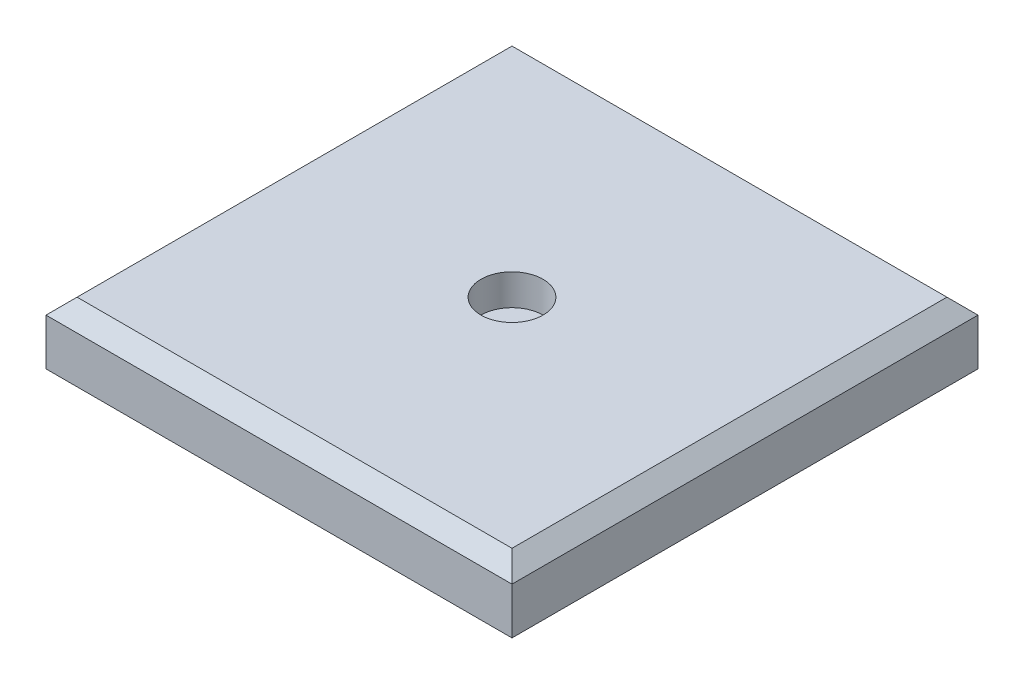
ISO-10303-21;
HEADER;
FILE_DESCRIPTION(('STEP AP214'),'2;1');
FILE_NAME('part.step','',(''),(''),'','','');
FILE_SCHEMA(('AUTOMOTIVE_DESIGN { 1 0 10303 214 1 1 1 1 }'));
ENDSEC;
DATA;
#1=APPLICATION_CONTEXT('core data for automotive mechanical design processes');
#2=APPLICATION_PROTOCOL_DEFINITION('international standard','automotive_design',2000,#1);
#3=PRODUCT_CONTEXT('',#1,'mechanical');
#4=PRODUCT('Part','Part','',(#3));
#5=PRODUCT_RELATED_PRODUCT_CATEGORY('part','',(#4));
#6=PRODUCT_DEFINITION_FORMATION('','',#4);
#7=PRODUCT_DEFINITION_CONTEXT('part definition',#1,'design');
#8=PRODUCT_DEFINITION('design','',#6,#7);
#9=PRODUCT_DEFINITION_SHAPE('','',#8);
#10=(LENGTH_UNIT() NAMED_UNIT(*) SI_UNIT(.MILLI.,.METRE.));
#11=(NAMED_UNIT(*) PLANE_ANGLE_UNIT() SI_UNIT($,.RADIAN.));
#12=(NAMED_UNIT(*) SI_UNIT($,.STERADIAN.) SOLID_ANGLE_UNIT());
#13=UNCERTAINTY_MEASURE_WITH_UNIT(LENGTH_MEASURE(1.E-05),#10,'distance_accuracy_value','');
#14=(GEOMETRIC_REPRESENTATION_CONTEXT(3) GLOBAL_UNCERTAINTY_ASSIGNED_CONTEXT((#13)) GLOBAL_UNIT_ASSIGNED_CONTEXT((#10,
#11,#12)) REPRESENTATION_CONTEXT('',''));
#15=CARTESIAN_POINT('',(0.,0.,0.));
#16=DIRECTION('',(0.,0.,1.));
#17=DIRECTION('',(1.,0.,0.));
#18=AXIS2_PLACEMENT_3D('',#15,#16,#17);
#19=CARTESIAN_POINT('',(75.,20.,75.));
#20=DIRECTION('',(-1.,0.,0.));
#21=DIRECTION('',(0.,0.,1.));
#22=AXIS2_PLACEMENT_3D('',#19,#20,#21);
#23=PLANE('',#22);
#24=DIRECTION('',(0.,-1.,0.));
#25=VECTOR('',#24,1.);
#26=CARTESIAN_POINT('',(75.,20.,-75.));
#27=LINE('',#26,#25);
#28=CARTESIAN_POINT('',(75.,15.,-75.));
#29=VERTEX_POINT('',#28);
#30=CARTESIAN_POINT('',(75.,0.,-75.));
#31=VERTEX_POINT('',#30);
#32=EDGE_CURVE('E86',#29,#31,#27,.T.);
#33=ORIENTED_EDGE('',*,*,#32,.F.);
#34=DIRECTION('',(0.,0.,1.));
#35=VECTOR('',#34,1.);
#36=CARTESIAN_POINT('',(75.,15.,75.));
#37=LINE('',#36,#35);
#38=CARTESIAN_POINT('',(75.,15.,75.));
#39=VERTEX_POINT('',#38);
#40=EDGE_CURVE('E56',#29,#39,#37,.T.);
#41=ORIENTED_EDGE('',*,*,#40,.T.);
#42=DIRECTION('',(0.,-1.,0.));
#43=VECTOR('',#42,1.);
#44=CARTESIAN_POINT('',(75.,20.,75.));
#45=LINE('',#44,#43);
#46=CARTESIAN_POINT('',(75.,0.,75.));
#47=VERTEX_POINT('',#46);
#48=EDGE_CURVE('E106',#39,#47,#45,.T.);
#49=ORIENTED_EDGE('',*,*,#48,.T.);
#50=DIRECTION('',(0.,0.,-1.));
#51=VECTOR('',#50,1.);
#52=CARTESIAN_POINT('',(75.,0.,75.));
#53=LINE('',#52,#51);
#54=EDGE_CURVE('E102',#47,#31,#53,.T.);
#55=ORIENTED_EDGE('',*,*,#54,.T.);
#56=EDGE_LOOP('',(#33,#41,#49,#55));
#57=FACE_BOUND('',#56,.T.);
#58=ADVANCED_FACE('F32',(#57),#23,.F.);
#59=CARTESIAN_POINT('',(-75.,20.,-75.));
#60=DIRECTION('',(0.,0.,1.));
#61=DIRECTION('',(1.,0.,0.));
#62=AXIS2_PLACEMENT_3D('',#59,#60,#61);
#63=PLANE('',#62);
#64=DIRECTION('',(0.,-1.,0.));
#65=VECTOR('',#64,1.);
#66=CARTESIAN_POINT('',(-75.,20.,-75.));
#67=LINE('',#66,#65);
#68=CARTESIAN_POINT('',(-75.,15.,-75.));
#69=VERTEX_POINT('',#68);
#70=CARTESIAN_POINT('',(-75.,0.,-75.));
#71=VERTEX_POINT('',#70);
#72=EDGE_CURVE('E96',#69,#71,#67,.T.);
#73=ORIENTED_EDGE('',*,*,#72,.F.);
#74=DIRECTION('',(1.,0.,0.));
#75=VECTOR('',#74,1.);
#76=CARTESIAN_POINT('',(-75.,15.,-75.));
#77=LINE('',#76,#75);
#78=EDGE_CURVE('E93',#69,#29,#77,.T.);
#79=ORIENTED_EDGE('',*,*,#78,.T.);
#80=ORIENTED_EDGE('',*,*,#32,.T.);
#81=DIRECTION('',(-1.,0.,0.));
#82=VECTOR('',#81,1.);
#83=CARTESIAN_POINT('',(-75.,0.,-75.));
#84=LINE('',#83,#82);
#85=EDGE_CURVE('E90',#31,#71,#84,.T.);
#86=ORIENTED_EDGE('',*,*,#85,.T.);
#87=EDGE_LOOP('',(#73,#79,#80,#86));
#88=FACE_BOUND('',#87,.T.);
#89=ADVANCED_FACE('F89',(#88),#63,.F.);
#90=CARTESIAN_POINT('',(-75.,20.,75.));
#91=DIRECTION('',(1.,0.,0.));
#92=DIRECTION('',(0.,0.,-1.));
#93=AXIS2_PLACEMENT_3D('',#90,#91,#92);
#94=PLANE('',#93);
#95=DIRECTION('',(0.,-1.,0.));
#96=VECTOR('',#95,1.);
#97=CARTESIAN_POINT('',(-75.,20.,75.));
#98=LINE('',#97,#96);
#99=CARTESIAN_POINT('',(-75.,15.,75.));
#100=VERTEX_POINT('',#99);
#101=CARTESIAN_POINT('',(-75.,0.,75.));
#102=VERTEX_POINT('',#101);
#103=EDGE_CURVE('E119',#100,#102,#98,.T.);
#104=ORIENTED_EDGE('',*,*,#103,.F.);
#105=DIRECTION('',(0.,0.,-1.));
#106=VECTOR('',#105,1.);
#107=CARTESIAN_POINT('',(-75.,15.,75.));
#108=LINE('',#107,#106);
#109=EDGE_CURVE('E11',#100,#69,#108,.T.);
#110=ORIENTED_EDGE('',*,*,#109,.T.);
#111=ORIENTED_EDGE('',*,*,#72,.T.);
#112=DIRECTION('',(0.,0.,1.));
#113=VECTOR('',#112,1.);
#114=CARTESIAN_POINT('',(-75.,0.,75.));
#115=LINE('',#114,#113);
#116=EDGE_CURVE('E104',#71,#102,#115,.T.);
#117=ORIENTED_EDGE('',*,*,#116,.T.);
#118=EDGE_LOOP('',(#104,#110,#111,#117));
#119=FACE_BOUND('',#118,.T.);
#120=ADVANCED_FACE('F161',(#119),#94,.F.);
#121=CARTESIAN_POINT('',(-75.,20.,75.));
#122=DIRECTION('',(0.,0.,-1.));
#123=DIRECTION('',(-1.,0.,0.));
#124=AXIS2_PLACEMENT_3D('',#121,#122,#123);
#125=PLANE('',#124);
#126=ORIENTED_EDGE('',*,*,#48,.F.);
#127=DIRECTION('',(-1.,0.,0.));
#128=VECTOR('',#127,1.);
#129=CARTESIAN_POINT('',(-75.,15.,75.));
#130=LINE('',#129,#128);
#131=EDGE_CURVE('E41',#39,#100,#130,.T.);
#132=ORIENTED_EDGE('',*,*,#131,.T.);
#133=ORIENTED_EDGE('',*,*,#103,.T.);
#134=DIRECTION('',(1.,0.,0.));
#135=VECTOR('',#134,1.);
#136=CARTESIAN_POINT('',(-75.,0.,75.));
#137=LINE('',#136,#135);
#138=EDGE_CURVE('E116',#102,#47,#137,.T.);
#139=ORIENTED_EDGE('',*,*,#138,.T.);
#140=EDGE_LOOP('',(#126,#132,#133,#139));
#141=FACE_BOUND('',#140,.T.);
#142=ADVANCED_FACE('F153',(#141),#125,.F.);
#143=CARTESIAN_POINT('',(75.,20.,-75.));
#144=DIRECTION('',(0.,-1.,0.));
#145=DIRECTION('',(0.,0.,-1.));
#146=AXIS2_PLACEMENT_3D('',#143,#144,#145);
#147=PLANE('',#146);
#148=DIRECTION('',(0.,0.,-1.));
#149=VECTOR('',#148,1.);
#150=CARTESIAN_POINT('',(70.,20.,-75.));
#151=LINE('',#150,#149);
#152=CARTESIAN_POINT('',(70.,20.,70.));
#153=VERTEX_POINT('',#152);
#154=CARTESIAN_POINT('',(70.,20.,-70.));
#155=VERTEX_POINT('',#154);
#156=EDGE_CURVE('E125',#153,#155,#151,.T.);
#157=ORIENTED_EDGE('',*,*,#156,.T.);
#158=DIRECTION('',(-1.,0.,0.));
#159=VECTOR('',#158,1.);
#160=CARTESIAN_POINT('',(75.,20.,-70.));
#161=LINE('',#160,#159);
#162=CARTESIAN_POINT('',(-70.,20.,-70.));
#163=VERTEX_POINT('',#162);
#164=EDGE_CURVE('E127',#155,#163,#161,.T.);
#165=ORIENTED_EDGE('',*,*,#164,.T.);
#166=DIRECTION('',(0.,0.,1.));
#167=VECTOR('',#166,1.);
#168=CARTESIAN_POINT('',(-70.,20.,-75.));
#169=LINE('',#168,#167);
#170=CARTESIAN_POINT('',(-70.,20.,70.));
#171=VERTEX_POINT('',#170);
#172=EDGE_CURVE('E95',#163,#171,#169,.T.);
#173=ORIENTED_EDGE('',*,*,#172,.T.);
#174=DIRECTION('',(1.,0.,0.));
#175=VECTOR('',#174,1.);
#176=CARTESIAN_POINT('',(75.,20.,70.));
#177=LINE('',#176,#175);
#178=EDGE_CURVE('E123',#171,#153,#177,.T.);
#179=ORIENTED_EDGE('',*,*,#178,.T.);
#180=EDGE_LOOP('',(#157,#165,#173,#179));
#181=FACE_BOUND('',#180,.T.);
#182=CARTESIAN_POINT('',(0.,20.,0.));
#183=DIRECTION('',(0.,1.,0.));
#184=DIRECTION('',(0.,0.,1.));
#185=AXIS2_PLACEMENT_3D('',#182,#183,#184);
#186=CIRCLE('',#185,10.);
#187=CARTESIAN_POINT('',(0.,20.,10.));
#188=VERTEX_POINT('',#187);
#189=EDGE_CURVE('E111',#188,#188,#186,.T.);
#190=ORIENTED_EDGE('',*,*,#189,.F.);
#191=EDGE_LOOP('',(#190));
#192=FACE_BOUND('',#191,.T.);
#193=ADVANCED_FACE('F151',(#181,#192),#147,.F.);
#194=CARTESIAN_POINT('',(75.,0.,-75.));
#195=DIRECTION('',(0.,-1.,0.));
#196=DIRECTION('',(0.,0.,-1.));
#197=AXIS2_PLACEMENT_3D('',#194,#195,#196);
#198=PLANE('',#197);
#199=ORIENTED_EDGE('',*,*,#54,.F.);
#200=ORIENTED_EDGE('',*,*,#138,.F.);
#201=ORIENTED_EDGE('',*,*,#116,.F.);
#202=ORIENTED_EDGE('',*,*,#85,.F.);
#203=EDGE_LOOP('',(#199,#200,#201,#202));
#204=FACE_BOUND('',#203,.T.);
#205=ADVANCED_FACE('F100',(#204),#198,.T.);
#206=CARTESIAN_POINT('',(0.,10.,0.));
#207=DIRECTION('',(0.,1.,0.));
#208=DIRECTION('',(0.,0.,1.));
#209=AXIS2_PLACEMENT_3D('',#206,#207,#208);
#210=CYLINDRICAL_SURFACE('',#209,10.);
#211=CARTESIAN_POINT('',(0.,10.,0.));
#212=DIRECTION('',(0.,1.,0.));
#213=DIRECTION('',(0.,0.,1.));
#214=AXIS2_PLACEMENT_3D('',#211,#212,#213);
#215=CIRCLE('',#214,10.);
#216=CARTESIAN_POINT('',(0.,10.,10.));
#217=VERTEX_POINT('',#216);
#218=EDGE_CURVE('E108',#217,#217,#215,.T.);
#219=ORIENTED_EDGE('',*,*,#218,.F.);
#220=EDGE_LOOP('',(#219));
#221=FACE_BOUND('',#220,.T.);
#222=ORIENTED_EDGE('',*,*,#189,.T.);
#223=EDGE_LOOP('',(#222));
#224=FACE_BOUND('',#223,.T.);
#225=ADVANCED_FACE('F149',(#221,#224),#210,.F.);
#226=CARTESIAN_POINT('',(0.,10.,0.));
#227=DIRECTION('',(0.,1.,0.));
#228=DIRECTION('',(0.,0.,1.));
#229=AXIS2_PLACEMENT_3D('',#226,#227,#228);
#230=PLANE('',#229);
#231=ORIENTED_EDGE('',*,*,#218,.T.);
#232=EDGE_LOOP('',(#231));
#233=FACE_BOUND('',#232,.T.);
#234=ADVANCED_FACE('F183',(#233),#230,.T.);
#235=CARTESIAN_POINT('',(75.,20.,70.));
#236=DIRECTION('',(0.,-0.707106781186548,-0.707106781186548));
#237=DIRECTION('',(0.,0.707106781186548,-0.707106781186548));
#238=AXIS2_PLACEMENT_3D('',#235,#236,#237);
#239=PLANE('',#238);
#240=DIRECTION('',(0.577350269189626,0.577350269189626,-0.577350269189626));
#241=VECTOR('',#240,1.);
#242=CARTESIAN_POINT('',(-21.6666666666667,68.3333333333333,21.6666666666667));
#243=LINE('',#242,#241);
#244=EDGE_CURVE('E136',#100,#171,#243,.T.);
#245=ORIENTED_EDGE('',*,*,#244,.F.);
#246=ORIENTED_EDGE('',*,*,#131,.F.);
#247=DIRECTION('',(-0.577350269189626,0.577350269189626,-0.577350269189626));
#248=VECTOR('',#247,1.);
#249=CARTESIAN_POINT('',(71.6666666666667,18.3333333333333,71.6666666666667));
#250=LINE('',#249,#248);
#251=EDGE_CURVE('E36',#153,#39,#250,.F.);
#252=ORIENTED_EDGE('',*,*,#251,.F.);
#253=ORIENTED_EDGE('',*,*,#178,.F.);
#254=EDGE_LOOP('',(#245,#246,#252,#253));
#255=FACE_BOUND('',#254,.T.);
#256=ADVANCED_FACE('F34',(#255),#239,.F.);
#257=CARTESIAN_POINT('',(70.,20.,-75.));
#258=DIRECTION('',(-0.707106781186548,-0.707106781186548,0.));
#259=DIRECTION('',(0.707106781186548,-0.707106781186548,0.));
#260=AXIS2_PLACEMENT_3D('',#257,#258,#259);
#261=PLANE('',#260);
#262=ORIENTED_EDGE('',*,*,#251,.T.);
#263=ORIENTED_EDGE('',*,*,#40,.F.);
#264=DIRECTION('',(-0.577350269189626,0.577350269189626,0.577350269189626));
#265=VECTOR('',#264,1.);
#266=CARTESIAN_POINT('',(71.6666666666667,18.3333333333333,-71.6666666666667));
#267=LINE('',#266,#265);
#268=EDGE_CURVE('E135',#155,#29,#267,.F.);
#269=ORIENTED_EDGE('',*,*,#268,.F.);
#270=ORIENTED_EDGE('',*,*,#156,.F.);
#271=EDGE_LOOP('',(#262,#263,#269,#270));
#272=FACE_BOUND('',#271,.T.);
#273=ADVANCED_FACE('F178',(#272),#261,.F.);
#274=CARTESIAN_POINT('',(-70.,20.,-75.));
#275=DIRECTION('',(0.707106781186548,-0.707106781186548,0.));
#276=DIRECTION('',(0.707106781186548,0.707106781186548,0.));
#277=AXIS2_PLACEMENT_3D('',#274,#275,#276);
#278=PLANE('',#277);
#279=ORIENTED_EDGE('',*,*,#244,.T.);
#280=ORIENTED_EDGE('',*,*,#172,.F.);
#281=DIRECTION('',(-0.577350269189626,-0.577350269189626,-0.577350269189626));
#282=VECTOR('',#281,1.);
#283=CARTESIAN_POINT('',(-71.6666666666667,18.3333333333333,-71.6666666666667));
#284=LINE('',#283,#282);
#285=EDGE_CURVE('E133',#69,#163,#284,.F.);
#286=ORIENTED_EDGE('',*,*,#285,.F.);
#287=ORIENTED_EDGE('',*,*,#109,.F.);
#288=EDGE_LOOP('',(#279,#280,#286,#287));
#289=FACE_BOUND('',#288,.T.);
#290=ADVANCED_FACE('F175',(#289),#278,.F.);
#291=CARTESIAN_POINT('',(75.,20.,-70.));
#292=DIRECTION('',(0.,-0.707106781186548,0.707106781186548));
#293=DIRECTION('',(0.,-0.707106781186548,-0.707106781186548));
#294=AXIS2_PLACEMENT_3D('',#291,#292,#293);
#295=PLANE('',#294);
#296=ORIENTED_EDGE('',*,*,#268,.T.);
#297=ORIENTED_EDGE('',*,*,#78,.F.);
#298=ORIENTED_EDGE('',*,*,#285,.T.);
#299=ORIENTED_EDGE('',*,*,#164,.F.);
#300=EDGE_LOOP('',(#296,#297,#298,#299));
#301=FACE_BOUND('',#300,.T.);
#302=ADVANCED_FACE('F172',(#301),#295,.F.);
#303=CLOSED_SHELL('',(#58,#89,#120,#142,#193,#205,#225,#234,#256,#273,#290,#302));
#304=MANIFOLD_SOLID_BREP('B2',#303);
#305=ADVANCED_BREP_SHAPE_REPRESENTATION('',(#18,#304),#14);
#306=SHAPE_DEFINITION_REPRESENTATION(#9,#305);
ENDSEC;
END-ISO-10303-21;
